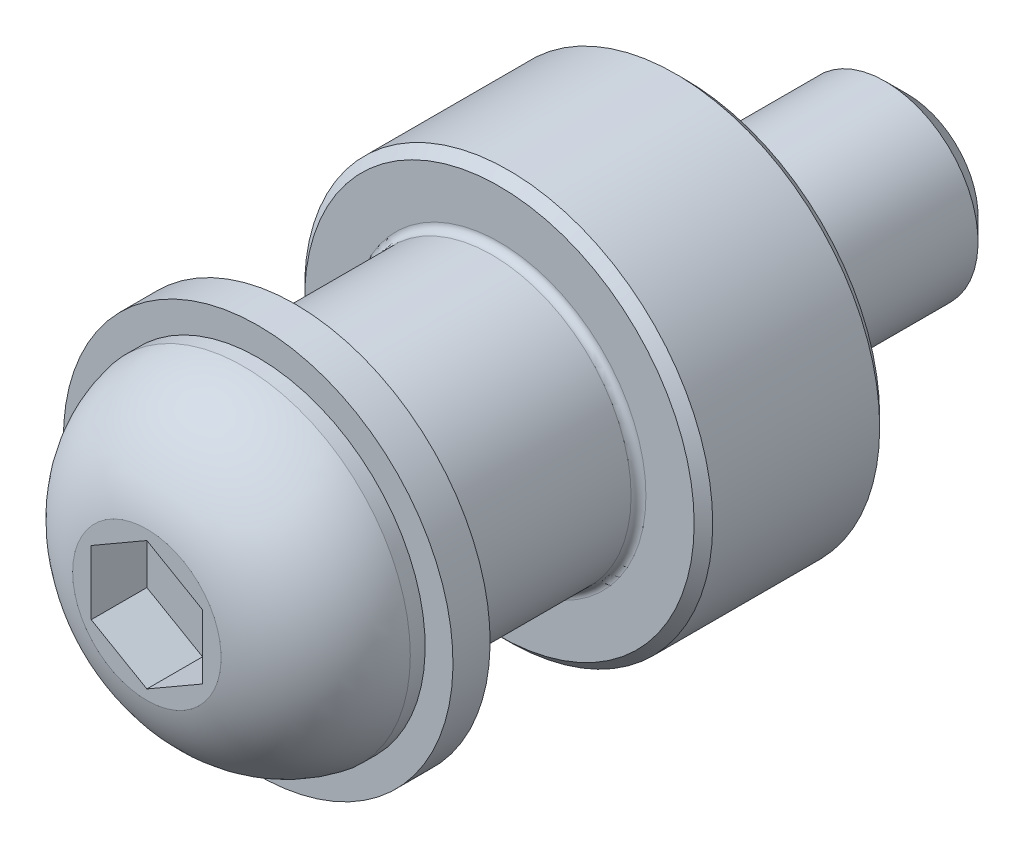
ISO-10303-21;
HEADER;
FILE_DESCRIPTION(('STEP AP214'),'2;1');
FILE_NAME('part.step','',(''),(''),'','','');
FILE_SCHEMA(('AUTOMOTIVE_DESIGN { 1 0 10303 214 1 1 1 1 }'));
ENDSEC;
DATA;
#1=APPLICATION_CONTEXT('core data for automotive mechanical design processes');
#2=APPLICATION_PROTOCOL_DEFINITION('international standard','automotive_design',2000,#1);
#3=PRODUCT_CONTEXT('',#1,'mechanical');
#4=PRODUCT('Part','Part','',(#3));
#5=PRODUCT_RELATED_PRODUCT_CATEGORY('part','',(#4));
#6=PRODUCT_DEFINITION_FORMATION('','',#4);
#7=PRODUCT_DEFINITION_CONTEXT('part definition',#1,'design');
#8=PRODUCT_DEFINITION('design','',#6,#7);
#9=PRODUCT_DEFINITION_SHAPE('','',#8);
#10=(LENGTH_UNIT() NAMED_UNIT(*) SI_UNIT(.MILLI.,.METRE.));
#11=(NAMED_UNIT(*) PLANE_ANGLE_UNIT() SI_UNIT($,.RADIAN.));
#12=(NAMED_UNIT(*) SI_UNIT($,.STERADIAN.) SOLID_ANGLE_UNIT());
#13=UNCERTAINTY_MEASURE_WITH_UNIT(LENGTH_MEASURE(1.E-05),#10,'distance_accuracy_value','');
#14=(GEOMETRIC_REPRESENTATION_CONTEXT(3) GLOBAL_UNCERTAINTY_ASSIGNED_CONTEXT((#13)) GLOBAL_UNIT_ASSIGNED_CONTEXT((#10,
#11,#12)) REPRESENTATION_CONTEXT('',''));
#15=CARTESIAN_POINT('',(0.,0.,0.));
#16=DIRECTION('',(0.,0.,1.));
#17=DIRECTION('',(1.,0.,0.));
#18=AXIS2_PLACEMENT_3D('',#15,#16,#17);
#19=CARTESIAN_POINT('',(0.,0.,20.5));
#20=DIRECTION('',(0.,0.,1.));
#21=DIRECTION('',(1.,0.,0.));
#22=AXIS2_PLACEMENT_3D('',#19,#20,#21);
#23=PLANE('',#22);
#24=CARTESIAN_POINT('',(0.,0.,20.5));
#25=DIRECTION('',(0.,0.,1.));
#26=DIRECTION('',(1.,0.,0.));
#27=AXIS2_PLACEMENT_3D('',#24,#25,#26);
#28=CIRCLE('',#27,7.);
#29=CARTESIAN_POINT('',(7.,0.,20.5));
#30=VERTEX_POINT('',#29);
#31=EDGE_CURVE('E23',#30,#30,#28,.T.);
#32=ORIENTED_EDGE('',*,*,#31,.T.);
#33=EDGE_LOOP('',(#32));
#34=FACE_BOUND('',#33,.T.);
#35=CARTESIAN_POINT('',(0.,0.,20.5));
#36=DIRECTION('',(0.,0.,1.));
#37=DIRECTION('',(1.,0.,0.));
#38=AXIS2_PLACEMENT_3D('',#35,#36,#37);
#39=CIRCLE('',#38,5.);
#40=CARTESIAN_POINT('',(5.,0.,20.5));
#41=VERTEX_POINT('',#40);
#42=EDGE_CURVE('E149',#41,#41,#39,.F.);
#43=ORIENTED_EDGE('',*,*,#42,.T.);
#44=EDGE_LOOP('',(#43));
#45=FACE_BOUND('',#44,.T.);
#46=ADVANCED_FACE('F14',(#34,#45),#23,.T.);
#47=CARTESIAN_POINT('',(0.,0.,20.5));
#48=DIRECTION('',(0.,0.,-1.));
#49=DIRECTION('',(-1.,0.,0.));
#50=AXIS2_PLACEMENT_3D('',#47,#48,#49);
#51=CYLINDRICAL_SURFACE('',#50,11.);
#52=CARTESIAN_POINT('',(0.,0.,0.5));
#53=DIRECTION('',(0.,0.,1.));
#54=DIRECTION('',(1.,0.,0.));
#55=AXIS2_PLACEMENT_3D('',#52,#53,#54);
#56=CIRCLE('',#55,11.);
#57=CARTESIAN_POINT('',(11.,0.,0.5));
#58=VERTEX_POINT('',#57);
#59=EDGE_CURVE('E165',#58,#58,#56,.T.);
#60=ORIENTED_EDGE('',*,*,#59,.T.);
#61=EDGE_LOOP('',(#60));
#62=FACE_BOUND('',#61,.T.);
#63=CARTESIAN_POINT('',(0.,0.,9.5));
#64=DIRECTION('',(0.,0.,1.));
#65=DIRECTION('',(1.,0.,0.));
#66=AXIS2_PLACEMENT_3D('',#63,#64,#65);
#67=CIRCLE('',#66,11.);
#68=CARTESIAN_POINT('',(11.,0.,9.5));
#69=VERTEX_POINT('',#68);
#70=EDGE_CURVE('E162',#69,#69,#67,.F.);
#71=ORIENTED_EDGE('',*,*,#70,.T.);
#72=EDGE_LOOP('',(#71));
#73=FACE_BOUND('',#72,.T.);
#74=ADVANCED_FACE('F389',(#62,#73),#51,.T.);
#75=CARTESIAN_POINT('',(0.,0.,0.));
#76=DIRECTION('',(0.,0.,1.));
#77=DIRECTION('',(1.,0.,0.));
#78=AXIS2_PLACEMENT_3D('',#75,#76,#77);
#79=PLANE('',#78);
#80=CARTESIAN_POINT('',(0.,0.,0.));
#81=DIRECTION('',(0.,0.,1.));
#82=DIRECTION('',(1.,0.,0.));
#83=AXIS2_PLACEMENT_3D('',#80,#81,#82);
#84=CIRCLE('',#83,10.5);
#85=CARTESIAN_POINT('',(10.5,0.,0.));
#86=VERTEX_POINT('',#85);
#87=EDGE_CURVE('E168',#86,#86,#84,.F.);
#88=ORIENTED_EDGE('',*,*,#87,.T.);
#89=EDGE_LOOP('',(#88));
#90=FACE_BOUND('',#89,.T.);
#91=CARTESIAN_POINT('',(0.,0.,0.));
#92=DIRECTION('',(0.,0.,-1.));
#93=DIRECTION('',(-1.,0.,0.));
#94=AXIS2_PLACEMENT_3D('',#91,#92,#93);
#95=CIRCLE('',#94,5.);
#96=CARTESIAN_POINT('',(-5.,0.,0.));
#97=VERTEX_POINT('',#96);
#98=EDGE_CURVE('E145',#97,#97,#95,.T.);
#99=ORIENTED_EDGE('',*,*,#98,.F.);
#100=EDGE_LOOP('',(#99));
#101=FACE_BOUND('',#100,.T.);
#102=ADVANCED_FACE('F381',(#90,#101),#79,.F.);
#103=CARTESIAN_POINT('',(0.,0.,10.));
#104=DIRECTION('',(0.,0.,1.));
#105=DIRECTION('',(1.,0.,0.));
#106=AXIS2_PLACEMENT_3D('',#103,#104,#105);
#107=PLANE('',#106);
#108=CARTESIAN_POINT('',(0.,0.,10.));
#109=DIRECTION('',(0.,0.,1.));
#110=DIRECTION('',(1.,0.,0.));
#111=AXIS2_PLACEMENT_3D('',#108,#109,#110);
#112=CIRCLE('',#111,10.5);
#113=CARTESIAN_POINT('',(10.5,0.,10.));
#114=VERTEX_POINT('',#113);
#115=EDGE_CURVE('E171',#114,#114,#112,.T.);
#116=ORIENTED_EDGE('',*,*,#115,.T.);
#117=EDGE_LOOP('',(#116));
#118=FACE_BOUND('',#117,.T.);
#119=CARTESIAN_POINT('',(0.,0.,10.));
#120=DIRECTION('',(0.,0.,1.));
#121=DIRECTION('',(1.,0.,0.));
#122=AXIS2_PLACEMENT_3D('',#119,#120,#121);
#123=CIRCLE('',#122,7.9);
#124=CARTESIAN_POINT('',(7.9,0.,10.));
#125=VERTEX_POINT('',#124);
#126=EDGE_CURVE('E159',#125,#125,#123,.F.);
#127=ORIENTED_EDGE('',*,*,#126,.T.);
#128=EDGE_LOOP('',(#127));
#129=FACE_BOUND('',#128,.T.);
#130=ADVANCED_FACE('F373',(#118,#129),#107,.T.);
#131=CARTESIAN_POINT('',(0.,0.,10.));
#132=DIRECTION('',(0.,0.,1.));
#133=DIRECTION('',(1.,0.,0.));
#134=AXIS2_PLACEMENT_3D('',#131,#132,#133);
#135=CYLINDRICAL_SURFACE('',#134,7.5);
#136=CARTESIAN_POINT('',(0.,0.,20.));
#137=DIRECTION('',(0.,0.,1.));
#138=DIRECTION('',(1.,0.,0.));
#139=AXIS2_PLACEMENT_3D('',#136,#137,#138);
#140=CIRCLE('',#139,7.5);
#141=CARTESIAN_POINT('',(7.5,0.,20.));
#142=VERTEX_POINT('',#141);
#143=EDGE_CURVE('E9',#142,#142,#140,.F.);
#144=ORIENTED_EDGE('',*,*,#143,.T.);
#145=EDGE_LOOP('',(#144));
#146=FACE_BOUND('',#145,.T.);
#147=CARTESIAN_POINT('',(0.,0.,10.4));
#148=DIRECTION('',(0.,0.,1.));
#149=DIRECTION('',(1.,0.,0.));
#150=AXIS2_PLACEMENT_3D('',#147,#148,#149);
#151=CIRCLE('',#150,7.5);
#152=CARTESIAN_POINT('',(7.5,0.,10.4));
#153=VERTEX_POINT('',#152);
#154=EDGE_CURVE('E154',#153,#153,#151,.T.);
#155=ORIENTED_EDGE('',*,*,#154,.T.);
#156=EDGE_LOOP('',(#155));
#157=FACE_BOUND('',#156,.T.);
#158=ADVANCED_FACE('F365',(#146,#157),#135,.T.);
#159=CARTESIAN_POINT('',(0.,0.,10.4));
#160=DIRECTION('',(0.,0.,1.));
#161=DIRECTION('',(1.,0.,0.));
#162=AXIS2_PLACEMENT_3D('',#159,#160,#161);
#163=TOROIDAL_SURFACE('',#162,7.9,0.4);
#164=ORIENTED_EDGE('',*,*,#126,.F.);
#165=EDGE_LOOP('',(#164));
#166=FACE_BOUND('',#165,.T.);
#167=ORIENTED_EDGE('',*,*,#154,.F.);
#168=EDGE_LOOP('',(#167));
#169=FACE_BOUND('',#168,.T.);
#170=ADVANCED_FACE('F357',(#166,#169),#163,.F.);
#171=CARTESIAN_POINT('',(0.,0.,0.5));
#172=DIRECTION('',(0.,0.,1.));
#173=DIRECTION('',(1.,0.,0.));
#174=AXIS2_PLACEMENT_3D('',#171,#172,#173);
#175=CONICAL_SURFACE('',#174,11.,0.785398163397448);
#176=ORIENTED_EDGE('',*,*,#87,.F.);
#177=EDGE_LOOP('',(#176));
#178=FACE_BOUND('',#177,.T.);
#179=ORIENTED_EDGE('',*,*,#59,.F.);
#180=EDGE_LOOP('',(#179));
#181=FACE_BOUND('',#180,.T.);
#182=ADVANCED_FACE('F349',(#178,#181),#175,.T.);
#183=CARTESIAN_POINT('',(0.,0.,10.));
#184=DIRECTION('',(0.,0.,-1.));
#185=DIRECTION('',(-1.,0.,0.));
#186=AXIS2_PLACEMENT_3D('',#183,#184,#185);
#187=CONICAL_SURFACE('',#186,10.5,0.78539816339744);
#188=ORIENTED_EDGE('',*,*,#70,.F.);
#189=EDGE_LOOP('',(#188));
#190=FACE_BOUND('',#189,.T.);
#191=ORIENTED_EDGE('',*,*,#115,.F.);
#192=EDGE_LOOP('',(#191));
#193=FACE_BOUND('',#192,.T.);
#194=ADVANCED_FACE('F217',(#190,#193),#187,.T.);
#195=CARTESIAN_POINT('',(0.,0.,20.5));
#196=DIRECTION('',(0.,0.,-1.));
#197=DIRECTION('',(-1.,0.,0.));
#198=AXIS2_PLACEMENT_3D('',#195,#196,#197);
#199=CONICAL_SURFACE('',#198,7.,0.785398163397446);
#200=ORIENTED_EDGE('',*,*,#143,.F.);
#201=EDGE_LOOP('',(#200));
#202=FACE_BOUND('',#201,.T.);
#203=ORIENTED_EDGE('',*,*,#31,.F.);
#204=EDGE_LOOP('',(#203));
#205=FACE_BOUND('',#204,.T.);
#206=ADVANCED_FACE('F210',(#202,#205),#199,.T.);
#207=CARTESIAN_POINT('',(0.,0.,-12.));
#208=DIRECTION('',(0.,0.,-1.));
#209=DIRECTION('',(1.,0.,0.));
#210=AXIS2_PLACEMENT_3D('',#207,#208,#209);
#211=PLANE('',#210);
#212=CARTESIAN_POINT('',(0.,0.,-12.));
#213=DIRECTION('',(0.,0.,-1.));
#214=DIRECTION('',(0.,1.,0.));
#215=AXIS2_PLACEMENT_3D('',#212,#213,#214);
#216=CIRCLE('',#215,3.8);
#217=CARTESIAN_POINT('',(0.,3.80000000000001,-12.));
#218=VERTEX_POINT('',#217);
#219=EDGE_CURVE('E140',#218,#218,#216,.T.);
#220=ORIENTED_EDGE('',*,*,#219,.T.);
#221=EDGE_LOOP('',(#220));
#222=FACE_BOUND('',#221,.T.);
#223=ADVANCED_FACE('F202',(#222),#211,.T.);
#224=CARTESIAN_POINT('',(0.,0.,-12.));
#225=DIRECTION('',(0.,0.,1.));
#226=DIRECTION('',(0.,-1.,0.));
#227=AXIS2_PLACEMENT_3D('',#224,#225,#226);
#228=CONICAL_SURFACE('',#227,3.8,0.785398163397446);
#229=CARTESIAN_POINT('',(0.,0.,-10.8));
#230=DIRECTION('',(0.,0.,-1.));
#231=DIRECTION('',(0.,1.,0.));
#232=AXIS2_PLACEMENT_3D('',#229,#230,#231);
#233=CIRCLE('',#232,5.);
#234=CARTESIAN_POINT('',(0.,5.,-10.8));
#235=VERTEX_POINT('',#234);
#236=EDGE_CURVE('E18',#235,#235,#233,.F.);
#237=ORIENTED_EDGE('',*,*,#236,.F.);
#238=EDGE_LOOP('',(#237));
#239=FACE_BOUND('',#238,.T.);
#240=ORIENTED_EDGE('',*,*,#219,.F.);
#241=EDGE_LOOP('',(#240));
#242=FACE_BOUND('',#241,.T.);
#243=ADVANCED_FACE('F16',(#239,#242),#228,.T.);
#244=CARTESIAN_POINT('',(0.,0.,-12.));
#245=DIRECTION('',(0.,0.,1.));
#246=DIRECTION('',(-1.,0.,0.));
#247=AXIS2_PLACEMENT_3D('',#244,#245,#246);
#248=CYLINDRICAL_SURFACE('',#247,5.);
#249=ORIENTED_EDGE('',*,*,#236,.T.);
#250=EDGE_LOOP('',(#249));
#251=FACE_BOUND('',#250,.T.);
#252=ORIENTED_EDGE('',*,*,#98,.T.);
#253=EDGE_LOOP('',(#252));
#254=FACE_BOUND('',#253,.T.);
#255=ADVANCED_FACE('F201',(#251,#254),#248,.T.);
#256=CARTESIAN_POINT('',(6.,-2.38015112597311E-13,26.));
#257=DIRECTION('',(0.,0.,-1.));
#258=DIRECTION('',(-1.,0.,0.));
#259=AXIS2_PLACEMENT_3D('',#256,#257,#258);
#260=PLANE('',#259);
#261=DIRECTION('',(-0.866025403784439,0.5,0.));
#262=VECTOR('',#261,1.);
#263=CARTESIAN_POINT('',(3.,1.73205080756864,26.));
#264=LINE('',#263,#262);
#265=CARTESIAN_POINT('',(3.,1.73205080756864,26.));
#266=VERTEX_POINT('',#265);
#267=CARTESIAN_POINT('',(0.,3.46410161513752,26.));
#268=VERTEX_POINT('',#267);
#269=EDGE_CURVE('E116',#266,#268,#264,.T.);
#270=ORIENTED_EDGE('',*,*,#269,.T.);
#271=DIRECTION('',(-0.866025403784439,-0.5,0.));
#272=VECTOR('',#271,1.);
#273=CARTESIAN_POINT('',(0.,3.46410161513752,26.));
#274=LINE('',#273,#272);
#275=CARTESIAN_POINT('',(-3.,1.73205080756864,26.));
#276=VERTEX_POINT('',#275);
#277=EDGE_CURVE('E99',#268,#276,#274,.T.);
#278=ORIENTED_EDGE('',*,*,#277,.T.);
#279=DIRECTION('',(0.,-1.,0.));
#280=VECTOR('',#279,1.);
#281=CARTESIAN_POINT('',(-3.,1.73205080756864,26.));
#282=LINE('',#281,#280);
#283=CARTESIAN_POINT('',(-3.,-1.73205080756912,26.));
#284=VERTEX_POINT('',#283);
#285=EDGE_CURVE('E97',#276,#284,#282,.T.);
#286=ORIENTED_EDGE('',*,*,#285,.T.);
#287=DIRECTION('',(0.866025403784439,-0.5,0.));
#288=VECTOR('',#287,1.);
#289=CARTESIAN_POINT('',(-3.,-1.73205080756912,26.));
#290=LINE('',#289,#288);
#291=CARTESIAN_POINT('',(0.,-3.464101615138,26.));
#292=VERTEX_POINT('',#291);
#293=EDGE_CURVE('E76',#284,#292,#290,.T.);
#294=ORIENTED_EDGE('',*,*,#293,.T.);
#295=DIRECTION('',(0.866025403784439,0.5,0.));
#296=VECTOR('',#295,1.);
#297=CARTESIAN_POINT('',(0.,-3.464101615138,26.));
#298=LINE('',#297,#296);
#299=CARTESIAN_POINT('',(3.,-1.73205080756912,26.));
#300=VERTEX_POINT('',#299);
#301=EDGE_CURVE('E87',#292,#300,#298,.T.);
#302=ORIENTED_EDGE('',*,*,#301,.T.);
#303=DIRECTION('',(0.,1.,0.));
#304=VECTOR('',#303,1.);
#305=CARTESIAN_POINT('',(3.,-1.73205080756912,26.));
#306=LINE('',#305,#304);
#307=EDGE_CURVE('E91',#300,#266,#306,.T.);
#308=ORIENTED_EDGE('',*,*,#307,.T.);
#309=EDGE_LOOP('',(#270,#278,#286,#294,#302,#308));
#310=FACE_BOUND('',#309,.T.);
#311=ADVANCED_FACE('F94',(#310),#260,.F.);
#312=CARTESIAN_POINT('',(-3.,1.73205080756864,26.));
#313=DIRECTION('',(-1.,0.,0.));
#314=DIRECTION('',(0.,-1.,0.));
#315=AXIS2_PLACEMENT_3D('',#312,#313,#314);
#316=PLANE('',#315);
#317=DIRECTION('',(0.,-1.,0.));
#318=VECTOR('',#317,1.);
#319=CARTESIAN_POINT('',(-3.,1.73205080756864,29.));
#320=LINE('',#319,#318);
#321=CARTESIAN_POINT('',(-3.,1.73205080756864,29.));
#322=VERTEX_POINT('',#321);
#323=CARTESIAN_POINT('',(-3.,-1.73205080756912,29.));
#324=VERTEX_POINT('',#323);
#325=EDGE_CURVE('E108',#322,#324,#320,.T.);
#326=ORIENTED_EDGE('',*,*,#325,.T.);
#327=DIRECTION('',(0.,0.,1.));
#328=VECTOR('',#327,1.);
#329=CARTESIAN_POINT('',(-3.,-1.73205080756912,26.));
#330=LINE('',#329,#328);
#331=EDGE_CURVE('E84',#284,#324,#330,.T.);
#332=ORIENTED_EDGE('',*,*,#331,.F.);
#333=ORIENTED_EDGE('',*,*,#285,.F.);
#334=DIRECTION('',(0.,0.,1.));
#335=VECTOR('',#334,1.);
#336=CARTESIAN_POINT('',(-3.,1.73205080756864,26.));
#337=LINE('',#336,#335);
#338=EDGE_CURVE('E121',#276,#322,#337,.T.);
#339=ORIENTED_EDGE('',*,*,#338,.T.);
#340=EDGE_LOOP('',(#326,#332,#333,#339));
#341=FACE_BOUND('',#340,.T.);
#342=ADVANCED_FACE('F181',(#341),#316,.F.);
#343=CARTESIAN_POINT('',(-3.,-1.73205080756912,26.));
#344=DIRECTION('',(-0.5,-0.866025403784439,0.));
#345=DIRECTION('',(0.866025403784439,-0.5,0.));
#346=AXIS2_PLACEMENT_3D('',#343,#344,#345);
#347=PLANE('',#346);
#348=DIRECTION('',(0.866025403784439,-0.5,0.));
#349=VECTOR('',#348,1.);
#350=CARTESIAN_POINT('',(-3.,-1.73205080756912,29.));
#351=LINE('',#350,#349);
#352=CARTESIAN_POINT('',(0.,-3.464101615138,29.));
#353=VERTEX_POINT('',#352);
#354=EDGE_CURVE('E79',#324,#353,#351,.T.);
#355=ORIENTED_EDGE('',*,*,#354,.T.);
#356=DIRECTION('',(0.,0.,1.));
#357=VECTOR('',#356,1.);
#358=CARTESIAN_POINT('',(0.,-3.464101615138,26.));
#359=LINE('',#358,#357);
#360=EDGE_CURVE('E72',#292,#353,#359,.T.);
#361=ORIENTED_EDGE('',*,*,#360,.F.);
#362=ORIENTED_EDGE('',*,*,#293,.F.);
#363=ORIENTED_EDGE('',*,*,#331,.T.);
#364=EDGE_LOOP('',(#355,#361,#362,#363));
#365=FACE_BOUND('',#364,.T.);
#366=ADVANCED_FACE('F74',(#365),#347,.F.);
#367=CARTESIAN_POINT('',(0.,-3.464101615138,26.));
#368=DIRECTION('',(0.5,-0.866025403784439,0.));
#369=DIRECTION('',(0.866025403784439,0.5,0.));
#370=AXIS2_PLACEMENT_3D('',#367,#368,#369);
#371=PLANE('',#370);
#372=DIRECTION('',(0.866025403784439,0.5,0.));
#373=VECTOR('',#372,1.);
#374=CARTESIAN_POINT('',(0.,-3.464101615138,29.));
#375=LINE('',#374,#373);
#376=CARTESIAN_POINT('',(3.,-1.73205080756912,29.));
#377=VERTEX_POINT('',#376);
#378=EDGE_CURVE('E112',#353,#377,#375,.T.);
#379=ORIENTED_EDGE('',*,*,#378,.T.);
#380=DIRECTION('',(0.,0.,1.));
#381=VECTOR('',#380,1.);
#382=CARTESIAN_POINT('',(3.,-1.73205080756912,26.));
#383=LINE('',#382,#381);
#384=EDGE_CURVE('E83',#300,#377,#383,.T.);
#385=ORIENTED_EDGE('',*,*,#384,.F.);
#386=ORIENTED_EDGE('',*,*,#301,.F.);
#387=ORIENTED_EDGE('',*,*,#360,.T.);
#388=EDGE_LOOP('',(#379,#385,#386,#387));
#389=FACE_BOUND('',#388,.T.);
#390=ADVANCED_FACE('F88',(#389),#371,.F.);
#391=CARTESIAN_POINT('',(3.,-1.73205080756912,26.));
#392=DIRECTION('',(1.,0.,0.));
#393=DIRECTION('',(0.,1.,0.));
#394=AXIS2_PLACEMENT_3D('',#391,#392,#393);
#395=PLANE('',#394);
#396=DIRECTION('',(0.,1.,0.));
#397=VECTOR('',#396,1.);
#398=CARTESIAN_POINT('',(3.,-1.73205080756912,29.));
#399=LINE('',#398,#397);
#400=CARTESIAN_POINT('',(3.,1.73205080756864,29.));
#401=VERTEX_POINT('',#400);
#402=EDGE_CURVE('E114',#377,#401,#399,.T.);
#403=ORIENTED_EDGE('',*,*,#402,.T.);
#404=DIRECTION('',(0.,0.,1.));
#405=VECTOR('',#404,1.);
#406=CARTESIAN_POINT('',(3.,1.73205080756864,26.));
#407=LINE('',#406,#405);
#408=EDGE_CURVE('E39',#266,#401,#407,.T.);
#409=ORIENTED_EDGE('',*,*,#408,.F.);
#410=ORIENTED_EDGE('',*,*,#307,.F.);
#411=ORIENTED_EDGE('',*,*,#384,.T.);
#412=EDGE_LOOP('',(#403,#409,#410,#411));
#413=FACE_BOUND('',#412,.T.);
#414=ADVANCED_FACE('F186',(#413),#395,.F.);
#415=CARTESIAN_POINT('',(3.,1.73205080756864,26.));
#416=DIRECTION('',(0.5,0.866025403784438,0.));
#417=DIRECTION('',(-0.866025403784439,0.5,0.));
#418=AXIS2_PLACEMENT_3D('',#415,#416,#417);
#419=PLANE('',#418);
#420=DIRECTION('',(-0.866025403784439,0.5,0.));
#421=VECTOR('',#420,1.);
#422=CARTESIAN_POINT('',(3.,1.73205080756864,29.));
#423=LINE('',#422,#421);
#424=CARTESIAN_POINT('',(0.,3.46410161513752,29.));
#425=VERTEX_POINT('',#424);
#426=EDGE_CURVE('E31',#401,#425,#423,.T.);
#427=ORIENTED_EDGE('',*,*,#426,.T.);
#428=DIRECTION('',(0.,0.,1.));
#429=VECTOR('',#428,1.);
#430=CARTESIAN_POINT('',(0.,3.46410161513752,26.));
#431=LINE('',#430,#429);
#432=EDGE_CURVE('E61',#268,#425,#431,.T.);
#433=ORIENTED_EDGE('',*,*,#432,.F.);
#434=ORIENTED_EDGE('',*,*,#269,.F.);
#435=ORIENTED_EDGE('',*,*,#408,.T.);
#436=EDGE_LOOP('',(#427,#433,#434,#435));
#437=FACE_BOUND('',#436,.T.);
#438=ADVANCED_FACE('F188',(#437),#419,.F.);
#439=CARTESIAN_POINT('',(0.,3.46410161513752,26.));
#440=DIRECTION('',(-0.5,0.866025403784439,0.));
#441=DIRECTION('',(-0.866025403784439,-0.5,0.));
#442=AXIS2_PLACEMENT_3D('',#439,#440,#441);
#443=PLANE('',#442);
#444=DIRECTION('',(-0.866025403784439,-0.5,0.));
#445=VECTOR('',#444,1.);
#446=CARTESIAN_POINT('',(0.,3.46410161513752,29.));
#447=LINE('',#446,#445);
#448=EDGE_CURVE('E105',#425,#322,#447,.T.);
#449=ORIENTED_EDGE('',*,*,#448,.T.);
#450=ORIENTED_EDGE('',*,*,#338,.F.);
#451=ORIENTED_EDGE('',*,*,#277,.F.);
#452=ORIENTED_EDGE('',*,*,#432,.T.);
#453=EDGE_LOOP('',(#449,#450,#451,#452));
#454=FACE_BOUND('',#453,.T.);
#455=ADVANCED_FACE('F177',(#454),#443,.F.);
#456=CARTESIAN_POINT('',(0.,-2.79912912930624E-13,29.));
#457=DIRECTION('',(0.,0.,-1.));
#458=DIRECTION('',(1.,0.,0.));
#459=AXIS2_PLACEMENT_3D('',#456,#457,#458);
#460=PLANE('',#459);
#461=ORIENTED_EDGE('',*,*,#448,.F.);
#462=ORIENTED_EDGE('',*,*,#426,.F.);
#463=ORIENTED_EDGE('',*,*,#402,.F.);
#464=ORIENTED_EDGE('',*,*,#378,.F.);
#465=ORIENTED_EDGE('',*,*,#354,.F.);
#466=ORIENTED_EDGE('',*,*,#325,.F.);
#467=EDGE_LOOP('',(#461,#462,#463,#464,#465,#466));
#468=FACE_BOUND('',#467,.T.);
#469=CARTESIAN_POINT('',(0.,-2.79912912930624E-13,29.));
#470=DIRECTION('',(0.,0.,1.));
#471=DIRECTION('',(-1.,0.,0.));
#472=AXIS2_PLACEMENT_3D('',#469,#470,#471);
#473=CIRCLE('',#472,4.);
#474=CARTESIAN_POINT('',(-4.,-2.79912912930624E-13,29.));
#475=VERTEX_POINT('',#474);
#476=EDGE_CURVE('E135',#475,#475,#473,.T.);
#477=ORIENTED_EDGE('',*,*,#476,.T.);
#478=EDGE_LOOP('',(#477));
#479=FACE_BOUND('',#478,.T.);
#480=ADVANCED_FACE('F183',(#468,#479),#460,.F.);
#481=CARTESIAN_POINT('',(0.,-2.35585614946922E-13,22.6520823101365));
#482=DIRECTION('',(0.,0.,1.));
#483=DIRECTION('',(-1.,0.,0.));
#484=AXIS2_PLACEMENT_3D('',#481,#482,#483);
#485=DEGENERATE_TOROIDAL_SURFACE('',#484,2.60216560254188,6.5,.T.);
#486=ORIENTED_EDGE('',*,*,#476,.F.);
#487=EDGE_LOOP('',(#486));
#488=FACE_BOUND('',#487,.T.);
#489=CARTESIAN_POINT('',(0.,-2.43601485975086E-13,23.8));
#490=DIRECTION('',(0.,0.,1.));
#491=DIRECTION('',(-1.,0.,0.));
#492=AXIS2_PLACEMENT_3D('',#489,#490,#491);
#493=CIRCLE('',#492,9.);
#494=CARTESIAN_POINT('',(-9.,-2.43601485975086E-13,23.8));
#495=VERTEX_POINT('',#494);
#496=EDGE_CURVE('E138',#495,#495,#493,.T.);
#497=ORIENTED_EDGE('',*,*,#496,.T.);
#498=EDGE_LOOP('',(#497));
#499=FACE_BOUND('',#498,.T.);
#500=ADVANCED_FACE('F230',(#488,#499),#485,.T.);
#501=CARTESIAN_POINT('',(0.,-2.89728831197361E-13,30.4056945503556));
#502=DIRECTION('',(0.,0.,1.));
#503=DIRECTION('',(-1.,0.,0.));
#504=AXIS2_PLACEMENT_3D('',#501,#502,#503);
#505=CYLINDRICAL_SURFACE('',#504,9.);
#506=ORIENTED_EDGE('',*,*,#496,.F.);
#507=EDGE_LOOP('',(#506));
#508=FACE_BOUND('',#507,.T.);
#509=CARTESIAN_POINT('',(0.,-2.38015112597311E-13,23.));
#510=DIRECTION('',(0.,0.,-1.));
#511=DIRECTION('',(0.,1.,0.));
#512=AXIS2_PLACEMENT_3D('',#509,#510,#511);
#513=CIRCLE('',#512,9.);
#514=CARTESIAN_POINT('',(0.,8.99999999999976,23.0000000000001));
#515=VERTEX_POINT('',#514);
#516=EDGE_CURVE('E132',#515,#515,#513,.T.);
#517=ORIENTED_EDGE('',*,*,#516,.F.);
#518=EDGE_LOOP('',(#517));
#519=FACE_BOUND('',#518,.T.);
#520=ADVANCED_FACE('F220',(#508,#519),#505,.T.);
#521=CARTESIAN_POINT('',(0.,-2.51981046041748E-13,23.));
#522=DIRECTION('',(0.,0.,-1.));
#523=DIRECTION('',(0.,1.,0.));
#524=AXIS2_PLACEMENT_3D('',#521,#522,#523);
#525=PLANE('',#524);
#526=CARTESIAN_POINT('',(0.,-2.51981046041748E-13,23.));
#527=DIRECTION('',(0.,0.,-1.));
#528=DIRECTION('',(0.,1.,0.));
#529=AXIS2_PLACEMENT_3D('',#526,#527,#528);
#530=CIRCLE('',#529,10.5);
#531=CARTESIAN_POINT('',(0.,10.4999999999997,23.0000000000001));
#532=VERTEX_POINT('',#531);
#533=EDGE_CURVE('E126',#532,#532,#530,.T.);
#534=ORIENTED_EDGE('',*,*,#533,.F.);
#535=EDGE_LOOP('',(#534));
#536=FACE_BOUND('',#535,.T.);
#537=ORIENTED_EDGE('',*,*,#516,.T.);
#538=EDGE_LOOP('',(#537));
#539=FACE_BOUND('',#538,.T.);
#540=ADVANCED_FACE('F231',(#536,#539),#525,.F.);
#541=CARTESIAN_POINT('',(0.,-2.38015112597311E-13,21.));
#542=DIRECTION('',(0.,0.,1.));
#543=DIRECTION('',(0.,-1.,0.));
#544=AXIS2_PLACEMENT_3D('',#541,#542,#543);
#545=CYLINDRICAL_SURFACE('',#544,10.5);
#546=CARTESIAN_POINT('',(0.,-2.38015112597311E-13,21.));
#547=DIRECTION('',(0.,0.,-1.));
#548=DIRECTION('',(0.,1.,0.));
#549=AXIS2_PLACEMENT_3D('',#546,#547,#548);
#550=CIRCLE('',#549,10.5);
#551=CARTESIAN_POINT('',(0.,10.4999999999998,21.0000000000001));
#552=VERTEX_POINT('',#551);
#553=EDGE_CURVE('E129',#552,#552,#550,.T.);
#554=ORIENTED_EDGE('',*,*,#553,.F.);
#555=EDGE_LOOP('',(#554));
#556=FACE_BOUND('',#555,.T.);
#557=ORIENTED_EDGE('',*,*,#533,.T.);
#558=EDGE_LOOP('',(#557));
#559=FACE_BOUND('',#558,.T.);
#560=ADVANCED_FACE('F222',(#556,#559),#545,.T.);
#561=CARTESIAN_POINT('',(0.,-2.38015112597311E-13,21.));
#562=DIRECTION('',(0.,0.,-1.));
#563=DIRECTION('',(0.,1.,0.));
#564=AXIS2_PLACEMENT_3D('',#561,#562,#563);
#565=PLANE('',#564);
#566=ORIENTED_EDGE('',*,*,#553,.T.);
#567=EDGE_LOOP('',(#566));
#568=FACE_BOUND('',#567,.T.);
#569=CARTESIAN_POINT('',(0.,-2.38015112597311E-13,21.));
#570=DIRECTION('',(0.,0.,-1.));
#571=DIRECTION('',(0.,1.,0.));
#572=AXIS2_PLACEMENT_3D('',#569,#570,#571);
#573=CIRCLE('',#572,5.);
#574=CARTESIAN_POINT('',(0.,4.99999999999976,21.));
#575=VERTEX_POINT('',#574);
#576=EDGE_CURVE('E118',#575,#575,#573,.T.);
#577=ORIENTED_EDGE('',*,*,#576,.F.);
#578=EDGE_LOOP('',(#577));
#579=FACE_BOUND('',#578,.T.);
#580=ADVANCED_FACE('F226',(#568,#579),#565,.T.);
#581=ORIENTED_EDGE('',*,*,#42,.F.);
#582=EDGE_LOOP('',(#581));
#583=FACE_BOUND('',#582,.T.);
#584=ORIENTED_EDGE('',*,*,#576,.T.);
#585=EDGE_LOOP('',(#584));
#586=FACE_BOUND('',#585,.T.);
#587=ADVANCED_FACE('F197',(#583,#586),#248,.T.);
#588=CLOSED_SHELL('',(#46,#74,#102,#130,#158,#170,#182,#194,#206,#223,#243,#255,#311,#342,#366,
#390,#414,#438,#455,#480,#500,#520,#540,#560,#580,#587));
#589=MANIFOLD_SOLID_BREP('B1',#588);
#590=ADVANCED_BREP_SHAPE_REPRESENTATION('',(#18,#589),#14);
#591=SHAPE_DEFINITION_REPRESENTATION(#9,#590);
ENDSEC;
END-ISO-10303-21;
